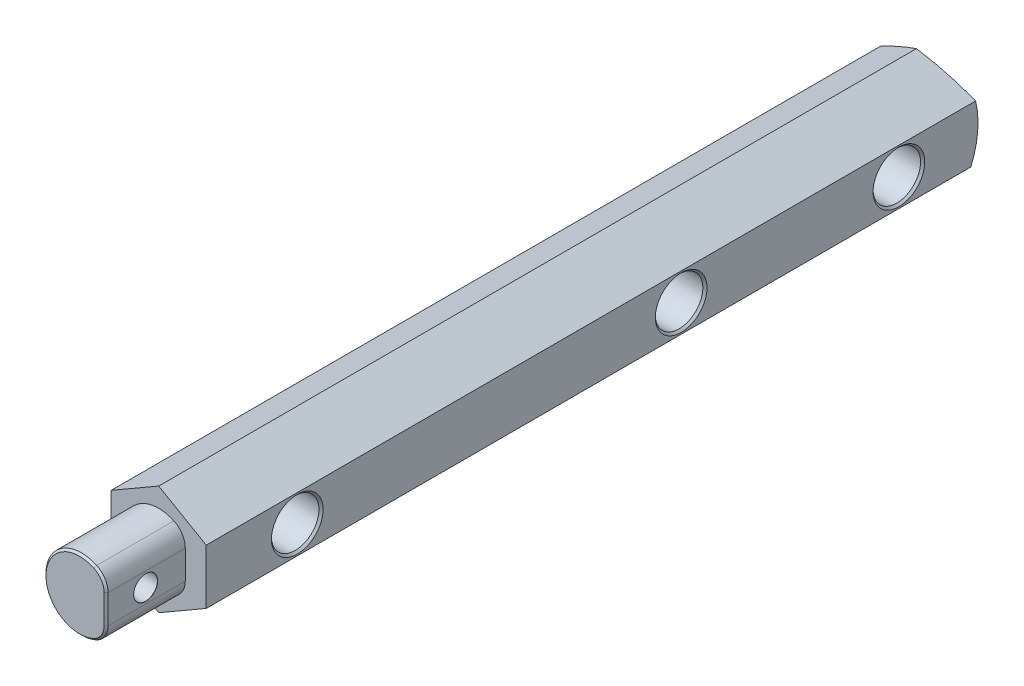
ISO-10303-21;
HEADER;
FILE_DESCRIPTION(('STEP AP214'),'2;1');
FILE_NAME('part.step','',(''),(''),'','','');
FILE_SCHEMA(('AUTOMOTIVE_DESIGN { 1 0 10303 214 1 1 1 1 }'));
ENDSEC;
DATA;
#1=APPLICATION_CONTEXT('core data for automotive mechanical design processes');
#2=APPLICATION_PROTOCOL_DEFINITION('international standard','automotive_design',2000,#1);
#3=PRODUCT_CONTEXT('',#1,'mechanical');
#4=PRODUCT('Part','Part','',(#3));
#5=PRODUCT_RELATED_PRODUCT_CATEGORY('part','',(#4));
#6=PRODUCT_DEFINITION_FORMATION('','',#4);
#7=PRODUCT_DEFINITION_CONTEXT('part definition',#1,'design');
#8=PRODUCT_DEFINITION('design','',#6,#7);
#9=PRODUCT_DEFINITION_SHAPE('','',#8);
#10=(LENGTH_UNIT() NAMED_UNIT(*) SI_UNIT(.MILLI.,.METRE.));
#11=(NAMED_UNIT(*) PLANE_ANGLE_UNIT() SI_UNIT($,.RADIAN.));
#12=(NAMED_UNIT(*) SI_UNIT($,.STERADIAN.) SOLID_ANGLE_UNIT());
#13=UNCERTAINTY_MEASURE_WITH_UNIT(LENGTH_MEASURE(1.E-05),#10,'distance_accuracy_value','');
#14=(GEOMETRIC_REPRESENTATION_CONTEXT(3) GLOBAL_UNCERTAINTY_ASSIGNED_CONTEXT((#13)) GLOBAL_UNIT_ASSIGNED_CONTEXT((#10,
#11,#12)) REPRESENTATION_CONTEXT('',''));
#15=CARTESIAN_POINT('',(0.,0.,0.));
#16=DIRECTION('',(0.,0.,1.));
#17=DIRECTION('',(1.,0.,0.));
#18=AXIS2_PLACEMENT_3D('',#15,#16,#17);
#19=CARTESIAN_POINT('',(11.9999999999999,6.92820323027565,195.));
#20=DIRECTION('',(-0.499999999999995,-0.866025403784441,0.));
#21=DIRECTION('',(0.866025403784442,-0.499999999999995,0.));
#22=AXIS2_PLACEMENT_3D('',#19,#20,#21);
#23=PLANE('',#22);
#24=DIRECTION('',(0.,0.,-1.));
#25=VECTOR('',#24,1.);
#26=CARTESIAN_POINT('',(11.9999999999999,6.92820323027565,195.));
#27=LINE('',#26,#25);
#28=CARTESIAN_POINT('',(11.9999999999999,6.92820323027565,195.));
#29=VERTEX_POINT('',#28);
#30=CARTESIAN_POINT('',(11.9999999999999,6.92820323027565,0.592597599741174));
#31=VERTEX_POINT('',#30);
#32=EDGE_CURVE('E145',#29,#31,#27,.T.);
#33=ORIENTED_EDGE('',*,*,#32,.T.);
#34=CARTESIAN_POINT('',(20.7846096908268,1.85640646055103,22.));
#35=DIRECTION('',(-0.499999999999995,-0.866025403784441,0.));
#36=DIRECTION('',(0.866025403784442,-0.499999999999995,0.));
#37=AXIS2_PLACEMENT_3D('',#34,#35,#36);
#38=ELLIPSE('',#37,44.0000000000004,22.);
#39=CARTESIAN_POINT('',(0.,13.856406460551,3.56091108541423));
#40=VERTEX_POINT('',#39);
#41=EDGE_CURVE('E139',#31,#40,#38,.F.);
#42=ORIENTED_EDGE('',*,*,#41,.T.);
#43=DIRECTION('',(0.,0.,-1.));
#44=VECTOR('',#43,1.);
#45=CARTESIAN_POINT('',(0.,13.856406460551,195.));
#46=LINE('',#45,#44);
#47=CARTESIAN_POINT('',(0.,13.856406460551,195.));
#48=VERTEX_POINT('',#47);
#49=EDGE_CURVE('E143',#48,#40,#46,.T.);
#50=ORIENTED_EDGE('',*,*,#49,.F.);
#51=DIRECTION('',(-0.866025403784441,0.499999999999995,0.));
#52=VECTOR('',#51,1.);
#53=CARTESIAN_POINT('',(11.9999999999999,6.92820323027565,195.));
#54=LINE('',#53,#52);
#55=EDGE_CURVE('E219',#29,#48,#54,.T.);
#56=ORIENTED_EDGE('',*,*,#55,.F.);
#57=EDGE_LOOP('',(#33,#42,#50,#56));
#58=FACE_BOUND('',#57,.T.);
#59=ADVANCED_FACE('F43',(#58),#23,.F.);
#60=CARTESIAN_POINT('',(0.,-13.856406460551,195.));
#61=DIRECTION('',(-0.500000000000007,0.866025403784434,0.));
#62=DIRECTION('',(-0.866025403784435,-0.500000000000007,0.));
#63=AXIS2_PLACEMENT_3D('',#60,#61,#62);
#64=PLANE('',#63);
#65=DIRECTION('',(0.,0.,-1.));
#66=VECTOR('',#65,1.);
#67=CARTESIAN_POINT('',(0.,-13.856406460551,195.));
#68=LINE('',#67,#66);
#69=CARTESIAN_POINT('',(0.,-13.856406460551,195.));
#70=VERTEX_POINT('',#69);
#71=CARTESIAN_POINT('',(0.,-13.8564064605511,6.6017043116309));
#72=VERTEX_POINT('',#71);
#73=EDGE_CURVE('E234',#70,#72,#68,.T.);
#74=ORIENTED_EDGE('',*,*,#73,.T.);
#75=CARTESIAN_POINT('',(27.2153903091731,1.85640646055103,22.));
#76=DIRECTION('',(-0.500000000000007,0.866025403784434,0.));
#77=DIRECTION('',(0.866025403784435,0.500000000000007,0.));
#78=AXIS2_PLACEMENT_3D('',#75,#76,#77);
#79=ELLIPSE('',#78,43.9999999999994,22.);
#80=CARTESIAN_POINT('',(12.0000000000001,-6.9282032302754,1.82995705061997));
#81=VERTEX_POINT('',#80);
#82=EDGE_CURVE('E148',#72,#81,#79,.F.);
#83=ORIENTED_EDGE('',*,*,#82,.T.);
#84=DIRECTION('',(0.,0.,-1.));
#85=VECTOR('',#84,1.);
#86=CARTESIAN_POINT('',(12.0000000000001,-6.9282032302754,195.));
#87=LINE('',#86,#85);
#88=CARTESIAN_POINT('',(12.0000000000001,-6.9282032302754,195.));
#89=VERTEX_POINT('',#88);
#90=EDGE_CURVE('E231',#89,#81,#87,.T.);
#91=ORIENTED_EDGE('',*,*,#90,.F.);
#92=DIRECTION('',(0.866025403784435,0.500000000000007,0.));
#93=VECTOR('',#92,1.);
#94=CARTESIAN_POINT('',(0.,-13.856406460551,195.));
#95=LINE('',#94,#93);
#96=EDGE_CURVE('E226',#70,#89,#95,.T.);
#97=ORIENTED_EDGE('',*,*,#96,.F.);
#98=EDGE_LOOP('',(#74,#83,#91,#97));
#99=FACE_BOUND('',#98,.T.);
#100=ADVANCED_FACE('F340',(#99),#64,.F.);
#101=CARTESIAN_POINT('',(12.0000000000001,-6.9282032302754,195.));
#102=DIRECTION('',(-1.,0.,0.));
#103=DIRECTION('',(0.,-1.,0.));
#104=AXIS2_PLACEMENT_3D('',#101,#102,#103);
#105=PLANE('',#104);
#106=CARTESIAN_POINT('',(12.,0.,75.));
#107=DIRECTION('',(1.,0.,0.));
#108=DIRECTION('',(0.,0.,-1.));
#109=AXIS2_PLACEMENT_3D('',#106,#107,#108);
#110=CIRCLE('',#109,6.525);
#111=CARTESIAN_POINT('',(12.,0.,68.475));
#112=VERTEX_POINT('',#111);
#113=EDGE_CURVE('E294',#112,#112,#110,.T.);
#114=ORIENTED_EDGE('',*,*,#113,.F.);
#115=EDGE_LOOP('',(#114));
#116=FACE_BOUND('',#115,.T.);
#117=CARTESIAN_POINT('',(12.,2.09924271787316E-13,20.));
#118=DIRECTION('',(1.,0.,0.));
#119=DIRECTION('',(0.,0.,-1.));
#120=AXIS2_PLACEMENT_3D('',#117,#118,#119);
#121=CIRCLE('',#120,6.525);
#122=CARTESIAN_POINT('',(12.,2.09924271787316E-13,13.475));
#123=VERTEX_POINT('',#122);
#124=EDGE_CURVE('E279',#123,#123,#121,.T.);
#125=ORIENTED_EDGE('',*,*,#124,.F.);
#126=EDGE_LOOP('',(#125));
#127=FACE_BOUND('',#126,.T.);
#128=CARTESIAN_POINT('',(12.,1.24692111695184E-13,172.));
#129=DIRECTION('',(1.,0.,0.));
#130=DIRECTION('',(0.,0.,-1.));
#131=AXIS2_PLACEMENT_3D('',#128,#129,#130);
#132=CIRCLE('',#131,6.525);
#133=CARTESIAN_POINT('',(12.,1.24692111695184E-13,165.475));
#134=VERTEX_POINT('',#133);
#135=EDGE_CURVE('E264',#134,#134,#132,.T.);
#136=ORIENTED_EDGE('',*,*,#135,.F.);
#137=EDGE_LOOP('',(#136));
#138=FACE_BOUND('',#137,.T.);
#139=ORIENTED_EDGE('',*,*,#90,.T.);
#140=CARTESIAN_POINT('',(12.,1.85640646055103,22.));
#141=DIRECTION('',(-1.,0.,0.));
#142=DIRECTION('',(0.,-1.,0.));
#143=AXIS2_PLACEMENT_3D('',#140,#141,#142);
#144=CIRCLE('',#143,22.);
#145=EDGE_CURVE('E147',#81,#31,#144,.F.);
#146=ORIENTED_EDGE('',*,*,#145,.T.);
#147=ORIENTED_EDGE('',*,*,#32,.F.);
#148=DIRECTION('',(0.,1.,0.));
#149=VECTOR('',#148,1.);
#150=CARTESIAN_POINT('',(12.0000000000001,-6.9282032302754,195.));
#151=LINE('',#150,#149);
#152=EDGE_CURVE('E228',#89,#29,#151,.T.);
#153=ORIENTED_EDGE('',*,*,#152,.F.);
#154=EDGE_LOOP('',(#139,#146,#147,#153));
#155=FACE_BOUND('',#154,.T.);
#156=ADVANCED_FACE('F346',(#116,#127,#138,#155),#105,.F.);
#157=CARTESIAN_POINT('',(0.,13.856406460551,195.));
#158=DIRECTION('',(0.500000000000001,-0.866025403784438,0.));
#159=DIRECTION('',(0.866025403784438,0.500000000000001,0.));
#160=AXIS2_PLACEMENT_3D('',#157,#158,#159);
#161=PLANE('',#160);
#162=CARTESIAN_POINT('',(-20.7846096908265,1.85640646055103,22.));
#163=DIRECTION('',(0.500000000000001,-0.866025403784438,0.));
#164=DIRECTION('',(0.866025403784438,0.500000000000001,0.));
#165=AXIS2_PLACEMENT_3D('',#162,#163,#164);
#166=ELLIPSE('',#165,43.9999999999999,22.);
#167=CARTESIAN_POINT('',(-12.,6.92820323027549,0.592597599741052));
#168=VERTEX_POINT('',#167);
#169=EDGE_CURVE('E151',#168,#40,#166,.T.);
#170=ORIENTED_EDGE('',*,*,#169,.F.);
#171=DIRECTION('',(0.,0.,-1.));
#172=VECTOR('',#171,1.);
#173=CARTESIAN_POINT('',(-12.,6.92820323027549,195.));
#174=LINE('',#173,#172);
#175=CARTESIAN_POINT('',(-12.,6.92820323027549,195.));
#176=VERTEX_POINT('',#175);
#177=EDGE_CURVE('E164',#176,#168,#174,.T.);
#178=ORIENTED_EDGE('',*,*,#177,.F.);
#179=DIRECTION('',(-0.866025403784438,-0.500000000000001,0.));
#180=VECTOR('',#179,1.);
#181=CARTESIAN_POINT('',(0.,13.856406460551,195.));
#182=LINE('',#181,#180);
#183=EDGE_CURVE('E161',#48,#176,#182,.T.);
#184=ORIENTED_EDGE('',*,*,#183,.F.);
#185=ORIENTED_EDGE('',*,*,#49,.T.);
#186=EDGE_LOOP('',(#170,#178,#184,#185));
#187=FACE_BOUND('',#186,.T.);
#188=ADVANCED_FACE('F160',(#187),#161,.F.);
#189=CARTESIAN_POINT('',(-12.,6.92820323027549,195.));
#190=DIRECTION('',(1.,0.,0.));
#191=DIRECTION('',(0.,1.,0.));
#192=AXIS2_PLACEMENT_3D('',#189,#190,#191);
#193=PLANE('',#192);
#194=CARTESIAN_POINT('',(-12.0000000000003,0.,75.));
#195=DIRECTION('',(1.,0.,0.));
#196=DIRECTION('',(0.,0.,-1.));
#197=AXIS2_PLACEMENT_3D('',#194,#195,#196);
#198=CIRCLE('',#197,3.24999999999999);
#199=CARTESIAN_POINT('',(-12.0000000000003,0.,71.75));
#200=VERTEX_POINT('',#199);
#201=EDGE_CURVE('E282',#200,#200,#198,.T.);
#202=ORIENTED_EDGE('',*,*,#201,.T.);
#203=EDGE_LOOP('',(#202));
#204=FACE_BOUND('',#203,.T.);
#205=CARTESIAN_POINT('',(-12.0000000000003,2.09924271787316E-13,20.));
#206=DIRECTION('',(1.,0.,0.));
#207=DIRECTION('',(0.,0.,-1.));
#208=AXIS2_PLACEMENT_3D('',#205,#206,#207);
#209=CIRCLE('',#208,3.24999999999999);
#210=CARTESIAN_POINT('',(-12.0000000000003,2.09924271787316E-13,16.75));
#211=VERTEX_POINT('',#210);
#212=EDGE_CURVE('E267',#211,#211,#209,.T.);
#213=ORIENTED_EDGE('',*,*,#212,.T.);
#214=EDGE_LOOP('',(#213));
#215=FACE_BOUND('',#214,.T.);
#216=CARTESIAN_POINT('',(-12.0000000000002,1.24692111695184E-13,172.));
#217=DIRECTION('',(1.,0.,0.));
#218=DIRECTION('',(0.,0.,-1.));
#219=AXIS2_PLACEMENT_3D('',#216,#217,#218);
#220=CIRCLE('',#219,3.24999999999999);
#221=CARTESIAN_POINT('',(-12.0000000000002,1.24692111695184E-13,168.75));
#222=VERTEX_POINT('',#221);
#223=EDGE_CURVE('E252',#222,#222,#220,.T.);
#224=ORIENTED_EDGE('',*,*,#223,.T.);
#225=EDGE_LOOP('',(#224));
#226=FACE_BOUND('',#225,.T.);
#227=CARTESIAN_POINT('',(-12.,1.85640646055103,22.));
#228=DIRECTION('',(1.,0.,0.));
#229=DIRECTION('',(0.,1.,0.));
#230=AXIS2_PLACEMENT_3D('',#227,#228,#229);
#231=CIRCLE('',#230,22.);
#232=CARTESIAN_POINT('',(-12.,-6.92820323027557,1.82995705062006));
#233=VERTEX_POINT('',#232);
#234=EDGE_CURVE('E154',#233,#168,#231,.T.);
#235=ORIENTED_EDGE('',*,*,#234,.F.);
#236=DIRECTION('',(0.,0.,-1.));
#237=VECTOR('',#236,1.);
#238=CARTESIAN_POINT('',(-12.,-6.92820323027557,195.));
#239=LINE('',#238,#237);
#240=CARTESIAN_POINT('',(-12.,-6.92820323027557,195.));
#241=VERTEX_POINT('',#240);
#242=EDGE_CURVE('E168',#241,#233,#239,.T.);
#243=ORIENTED_EDGE('',*,*,#242,.F.);
#244=DIRECTION('',(0.,-1.,0.));
#245=VECTOR('',#244,1.);
#246=CARTESIAN_POINT('',(-12.,6.92820323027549,195.));
#247=LINE('',#246,#245);
#248=EDGE_CURVE('E222',#176,#241,#247,.T.);
#249=ORIENTED_EDGE('',*,*,#248,.F.);
#250=ORIENTED_EDGE('',*,*,#177,.T.);
#251=EDGE_LOOP('',(#235,#243,#249,#250));
#252=FACE_BOUND('',#251,.T.);
#253=ADVANCED_FACE('F246',(#204,#215,#226,#252),#193,.F.);
#254=CARTESIAN_POINT('',(-12.,-6.92820323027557,195.));
#255=DIRECTION('',(0.499999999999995,0.866025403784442,0.));
#256=DIRECTION('',(-0.866025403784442,0.499999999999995,0.));
#257=AXIS2_PLACEMENT_3D('',#254,#255,#256);
#258=PLANE('',#257);
#259=CARTESIAN_POINT('',(-27.2153903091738,1.85640646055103,22.));
#260=DIRECTION('',(0.499999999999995,0.866025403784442,0.));
#261=DIRECTION('',(0.866025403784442,-0.499999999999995,0.));
#262=AXIS2_PLACEMENT_3D('',#259,#260,#261);
#263=ELLIPSE('',#262,44.0000000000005,22.);
#264=EDGE_CURVE('E243',#72,#233,#263,.T.);
#265=ORIENTED_EDGE('',*,*,#264,.F.);
#266=ORIENTED_EDGE('',*,*,#73,.F.);
#267=DIRECTION('',(0.866025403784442,-0.499999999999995,0.));
#268=VECTOR('',#267,1.);
#269=CARTESIAN_POINT('',(-12.,-6.92820323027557,195.));
#270=LINE('',#269,#268);
#271=EDGE_CURVE('E224',#241,#70,#270,.T.);
#272=ORIENTED_EDGE('',*,*,#271,.F.);
#273=ORIENTED_EDGE('',*,*,#242,.T.);
#274=EDGE_LOOP('',(#265,#266,#272,#273));
#275=FACE_BOUND('',#274,.T.);
#276=ADVANCED_FACE('F241',(#275),#258,.F.);
#277=CARTESIAN_POINT('',(0.,0.,195.));
#278=DIRECTION('',(0.,0.,1.));
#279=DIRECTION('',(1.,0.,0.));
#280=AXIS2_PLACEMENT_3D('',#277,#278,#279);
#281=PLANE('',#280);
#282=ORIENTED_EDGE('',*,*,#55,.T.);
#283=ORIENTED_EDGE('',*,*,#183,.T.);
#284=ORIENTED_EDGE('',*,*,#248,.T.);
#285=ORIENTED_EDGE('',*,*,#271,.T.);
#286=ORIENTED_EDGE('',*,*,#96,.T.);
#287=ORIENTED_EDGE('',*,*,#152,.T.);
#288=EDGE_LOOP('',(#282,#283,#284,#285,#286,#287));
#289=FACE_BOUND('',#288,.T.);
#290=DIRECTION('',(0.,1.,0.));
#291=VECTOR('',#290,1.);
#292=CARTESIAN_POINT('',(6.7,0.,195.));
#293=LINE('',#292,#291);
#294=CARTESIAN_POINT('',(6.7,-3.62077339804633,195.));
#295=VERTEX_POINT('',#294);
#296=CARTESIAN_POINT('',(6.7,3.62077339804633,195.));
#297=VERTEX_POINT('',#296);
#298=EDGE_CURVE('E217',#295,#297,#293,.T.);
#299=ORIENTED_EDGE('',*,*,#298,.F.);
#300=CARTESIAN_POINT('',(1.7,-3.62077339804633,195.));
#301=DIRECTION('',(0.,0.,1.));
#302=DIRECTION('',(1.,0.,0.));
#303=AXIS2_PLACEMENT_3D('',#300,#301,#302);
#304=CIRCLE('',#303,5.);
#305=CARTESIAN_POINT('',(3.825,-8.14674014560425,195.));
#306=VERTEX_POINT('',#305);
#307=EDGE_CURVE('E208',#295,#306,#304,.F.);
#308=ORIENTED_EDGE('',*,*,#307,.T.);
#309=CARTESIAN_POINT('',(0.,0.,195.));
#310=DIRECTION('',(0.,0.,1.));
#311=DIRECTION('',(1.,0.,0.));
#312=AXIS2_PLACEMENT_3D('',#309,#310,#311);
#313=CIRCLE('',#312,9.);
#314=CARTESIAN_POINT('',(3.825,8.14674014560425,195.));
#315=VERTEX_POINT('',#314);
#316=EDGE_CURVE('E211',#306,#315,#313,.F.);
#317=ORIENTED_EDGE('',*,*,#316,.T.);
#318=CARTESIAN_POINT('',(1.7,3.62077339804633,195.));
#319=DIRECTION('',(0.,0.,1.));
#320=DIRECTION('',(1.,0.,0.));
#321=AXIS2_PLACEMENT_3D('',#318,#319,#320);
#322=CIRCLE('',#321,5.);
#323=EDGE_CURVE('E214',#315,#297,#322,.F.);
#324=ORIENTED_EDGE('',*,*,#323,.T.);
#325=EDGE_LOOP('',(#299,#308,#317,#324));
#326=FACE_BOUND('',#325,.T.);
#327=ADVANCED_FACE('F309',(#289,#326),#281,.T.);
#328=CARTESIAN_POINT('',(6.7,0.,215.));
#329=DIRECTION('',(1.,0.,0.));
#330=DIRECTION('',(0.,1.,0.));
#331=AXIS2_PLACEMENT_3D('',#328,#329,#330);
#332=PLANE('',#331);
#333=CARTESIAN_POINT('',(6.7,0.,205.));
#334=DIRECTION('',(1.,0.,0.));
#335=DIRECTION('',(0.,0.,-1.));
#336=AXIS2_PLACEMENT_3D('',#333,#334,#335);
#337=CIRCLE('',#336,3.025);
#338=CARTESIAN_POINT('',(6.7,0.,201.975));
#339=VERTEX_POINT('',#338);
#340=EDGE_CURVE('E300',#339,#339,#337,.T.);
#341=ORIENTED_EDGE('',*,*,#340,.F.);
#342=EDGE_LOOP('',(#341));
#343=FACE_BOUND('',#342,.T.);
#344=DIRECTION('',(0.,0.,-1.));
#345=VECTOR('',#344,1.);
#346=CARTESIAN_POINT('',(6.7,3.62077339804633,215.));
#347=LINE('',#346,#345);
#348=CARTESIAN_POINT('',(6.7,3.62077339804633,214.5));
#349=VERTEX_POINT('',#348);
#350=EDGE_CURVE('E206',#349,#297,#347,.T.);
#351=ORIENTED_EDGE('',*,*,#350,.F.);
#352=DIRECTION('',(0.,-1.,0.));
#353=VECTOR('',#352,1.);
#354=CARTESIAN_POINT('',(6.7,0.,214.5));
#355=LINE('',#354,#353);
#356=CARTESIAN_POINT('',(6.7,-3.62077339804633,214.5));
#357=VERTEX_POINT('',#356);
#358=EDGE_CURVE('E181',#349,#357,#355,.T.);
#359=ORIENTED_EDGE('',*,*,#358,.T.);
#360=DIRECTION('',(0.,0.,-1.));
#361=VECTOR('',#360,1.);
#362=CARTESIAN_POINT('',(6.7,-3.62077339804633,215.));
#363=LINE('',#362,#361);
#364=EDGE_CURVE('E191',#357,#295,#363,.T.);
#365=ORIENTED_EDGE('',*,*,#364,.T.);
#366=ORIENTED_EDGE('',*,*,#298,.T.);
#367=EDGE_LOOP('',(#351,#359,#365,#366));
#368=FACE_BOUND('',#367,.T.);
#369=ADVANCED_FACE('F306',(#343,#368),#332,.T.);
#370=CARTESIAN_POINT('',(1.7,3.62077339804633,215.));
#371=DIRECTION('',(0.,0.,-1.));
#372=DIRECTION('',(-1.,0.,0.));
#373=AXIS2_PLACEMENT_3D('',#370,#371,#372);
#374=CYLINDRICAL_SURFACE('',#373,5.);
#375=DIRECTION('',(0.,0.,-1.));
#376=VECTOR('',#375,1.);
#377=CARTESIAN_POINT('',(3.825,8.14674014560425,215.));
#378=LINE('',#377,#376);
#379=CARTESIAN_POINT('',(3.825,8.14674014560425,214.5));
#380=VERTEX_POINT('',#379);
#381=EDGE_CURVE('E201',#380,#315,#378,.T.);
#382=ORIENTED_EDGE('',*,*,#381,.F.);
#383=CARTESIAN_POINT('',(1.7,3.62077339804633,214.5));
#384=DIRECTION('',(0.,0.,1.));
#385=DIRECTION('',(1.,0.,0.));
#386=AXIS2_PLACEMENT_3D('',#383,#384,#385);
#387=CIRCLE('',#386,5.);
#388=EDGE_CURVE('E58',#380,#349,#387,.F.);
#389=ORIENTED_EDGE('',*,*,#388,.T.);
#390=ORIENTED_EDGE('',*,*,#350,.T.);
#391=ORIENTED_EDGE('',*,*,#323,.F.);
#392=EDGE_LOOP('',(#382,#389,#390,#391));
#393=FACE_BOUND('',#392,.T.);
#394=ADVANCED_FACE('F308',(#393),#374,.T.);
#395=CARTESIAN_POINT('',(0.,0.,215.));
#396=DIRECTION('',(0.,0.,-1.));
#397=DIRECTION('',(-1.,0.,0.));
#398=AXIS2_PLACEMENT_3D('',#395,#396,#397);
#399=CYLINDRICAL_SURFACE('',#398,9.);
#400=CARTESIAN_POINT('',(-9.,0.,202.));
#401=CARTESIAN_POINT('',(-9.00000045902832,0.16369008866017,201.999999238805));
#402=CARTESIAN_POINT('',(-8.99549308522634,0.327375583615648,202.013440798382));
#403=CARTESIAN_POINT('',(-8.97795630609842,0.649925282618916,202.066687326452));
#404=CARTESIAN_POINT('',(-8.96492601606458,0.808788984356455,202.106495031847));
#405=CARTESIAN_POINT('',(-8.93175923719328,1.11699836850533,202.210957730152));
#406=CARTESIAN_POINT('',(-8.9116346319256,1.2663594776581,202.275571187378));
#407=CARTESIAN_POINT('',(-8.86633337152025,1.55212481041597,202.427623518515));
#408=CARTESIAN_POINT('',(-8.84115572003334,1.68852647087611,202.515066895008));
#409=CARTESIAN_POINT('',(-8.78742283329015,1.94922502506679,202.713477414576));
#410=CARTESIAN_POINT('',(-8.75878669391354,2.07301110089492,202.825093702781));
#411=CARTESIAN_POINT('',(-8.70180944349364,2.30049807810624,203.06730146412));
#412=CARTESIAN_POINT('',(-8.67346839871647,2.40419455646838,203.197897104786));
#413=CARTESIAN_POINT('',(-8.61939997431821,2.59147482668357,203.478955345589));
#414=CARTESIAN_POINT('',(-8.59377117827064,2.6743945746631,203.629881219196));
#415=CARTESIAN_POINT('',(-8.54925916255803,2.81345662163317,203.944528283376));
#416=CARTESIAN_POINT('',(-8.53037388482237,2.86960709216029,204.108245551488));
#417=CARTESIAN_POINT('',(-8.50233909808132,2.95162038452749,204.43801966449));
#418=CARTESIAN_POINT('',(-8.49288287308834,2.97844034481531,204.603811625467));
#419=CARTESIAN_POINT('',(-8.48386969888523,3.00402337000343,204.937791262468));
#420=CARTESIAN_POINT('',(-8.4843096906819,3.00279510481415,205.105978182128));
#421=CARTESIAN_POINT('',(-8.49477045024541,2.97305971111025,205.431809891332));
#422=CARTESIAN_POINT('',(-8.50435247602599,2.94580173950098,205.589585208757));
#423=CARTESIAN_POINT('',(-8.53129973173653,2.86681848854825,205.898180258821));
#424=CARTESIAN_POINT('',(-8.54866589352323,2.81509027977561,206.048999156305));
#425=CARTESIAN_POINT('',(-8.58953733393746,2.68781717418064,206.342238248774));
#426=CARTESIAN_POINT('',(-8.61313697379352,2.61190214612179,206.484484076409));
#427=CARTESIAN_POINT('',(-8.66377675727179,2.43866731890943,206.754612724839));
#428=CARTESIAN_POINT('',(-8.6908178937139,2.34134133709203,206.8824913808));
#429=CARTESIAN_POINT('',(-8.74701987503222,2.12204799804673,207.127274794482));
#430=CARTESIAN_POINT('',(-8.77621768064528,1.99905945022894,207.243258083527));
#431=CARTESIAN_POINT('',(-8.8322081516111,1.73501870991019,207.45319379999));
#432=CARTESIAN_POINT('',(-8.85900058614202,1.59396478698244,207.547144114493));
#433=CARTESIAN_POINT('',(-8.90751323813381,1.2958428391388,207.711088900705));
#434=CARTESIAN_POINT('',(-8.92918050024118,1.138629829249,207.780836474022));
#435=CARTESIAN_POINT('',(-8.96461701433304,0.813807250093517,207.892609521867));
#436=CARTESIAN_POINT('',(-8.97838900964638,0.646201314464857,207.93464462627));
#437=CARTESIAN_POINT('',(-8.99602881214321,0.313151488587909,207.988166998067));
#438=CARTESIAN_POINT('',(-9.00030005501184,0.147928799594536,208.000899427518));
#439=CARTESIAN_POINT('',(-8.99966708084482,-0.182325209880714,207.999001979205));
#440=CARTESIAN_POINT('',(-8.99476441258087,-0.347356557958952,207.98437672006));
#441=CARTESIAN_POINT('',(-8.97660074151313,-0.667559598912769,207.929164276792));
#442=CARTESIAN_POINT('',(-8.96358596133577,-0.822878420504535,207.889341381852));
#443=CARTESIAN_POINT('',(-8.9307554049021,-1.12456787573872,207.7858196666));
#444=CARTESIAN_POINT('',(-8.91093876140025,-1.27093736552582,207.722117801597));
#445=CARTESIAN_POINT('',(-8.86586793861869,-1.55486488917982,207.570788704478));
#446=CARTESIAN_POINT('',(-8.84048444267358,-1.69208987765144,207.48257622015));
#447=CARTESIAN_POINT('',(-8.78715761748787,-1.95019449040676,207.28541754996));
#448=CARTESIAN_POINT('',(-8.75921350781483,-2.07106910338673,207.176465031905));
#449=CARTESIAN_POINT('',(-8.70230543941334,-2.2987575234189,206.93506374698));
#450=CARTESIAN_POINT('',(-8.67335283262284,-2.40468290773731,206.801772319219));
#451=CARTESIAN_POINT('',(-8.61899919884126,-2.59277256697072,206.518685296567));
#452=CARTESIAN_POINT('',(-8.59359820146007,-2.67493664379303,206.368889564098));
#453=CARTESIAN_POINT('',(-8.54947175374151,-2.81279079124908,206.05698095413));
#454=CARTESIAN_POINT('',(-8.53073282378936,-2.86853439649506,205.894893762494));
#455=CARTESIAN_POINT('',(-8.50232496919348,-2.95168400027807,205.562864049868));
#456=CARTESIAN_POINT('',(-8.49265195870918,-2.97910276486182,205.392925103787));
#457=CARTESIAN_POINT('',(-8.48393576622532,-3.00382884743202,205.059408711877));
#458=CARTESIAN_POINT('',(-8.48437200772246,-3.00261077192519,204.89595297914));
#459=CARTESIAN_POINT('',(-8.49453809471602,-2.97372688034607,204.571704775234));
#460=CARTESIAN_POINT('',(-8.50426738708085,-2.94606263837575,204.410912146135));
#461=CARTESIAN_POINT('',(-8.53153572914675,-2.86611543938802,204.099593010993));
#462=CARTESIAN_POINT('',(-8.54892294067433,-2.81431003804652,203.948929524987));
#463=CARTESIAN_POINT('',(-8.58949196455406,-2.68793809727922,203.658317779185));
#464=CARTESIAN_POINT('',(-8.6126750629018,-2.6133665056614,203.518371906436));
#465=CARTESIAN_POINT('',(-8.66348487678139,-2.43978207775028,203.246548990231));
#466=CARTESIAN_POINT('',(-8.69126134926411,-2.33984472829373,203.115290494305));
#467=CARTESIAN_POINT('',(-8.74750068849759,-2.11992864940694,202.870930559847));
#468=CARTESIAN_POINT('',(-8.77596374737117,-1.99994425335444,202.757834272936));
#469=CARTESIAN_POINT('',(-8.83170091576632,-1.73772467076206,202.548566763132));
#470=CARTESIAN_POINT('',(-8.8588854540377,-1.59480454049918,202.453226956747));
#471=CARTESIAN_POINT('',(-8.90777973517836,-1.29407207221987,202.288028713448));
#472=CARTESIAN_POINT('',(-8.9294908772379,-1.13626355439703,202.218163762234));
#473=CARTESIAN_POINT('',(-8.96416545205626,-0.817480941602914,202.108835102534));
#474=CARTESIAN_POINT('',(-8.97747637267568,-0.656963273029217,202.06815260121));
#475=CARTESIAN_POINT('',(-8.99539221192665,-0.330961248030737,202.013739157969));
#476=CARTESIAN_POINT('',(-8.99999953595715,-0.165478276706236,202.00000076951));
#477=CARTESIAN_POINT('',(-9.,0.,202.));
#478=B_SPLINE_CURVE_WITH_KNOTS('',3,(#400,#401,#402,#403,#404,#405,#406,#407,#408,#409,#410,
#411,#412,#413,#414,#415,#416,#417,#418,#419,#420,#421,#422,#423,#424,#425,#426,#427,#428,#429,
#430,#431,#432,#433,#434,#435,#436,#437,#438,#439,#440,#441,#442,#443,#444,#445,#446,#447,#448,
#449,#450,#451,#452,#453,#454,#455,#456,#457,#458,#459,#460,#461,#462,#463,#464,#465,#466,#467,
#468,#469,#470,#471,#472,#473,#474,#475,#476,#477),.UNSPECIFIED.,.T.,.F.,(4,2,2,2,2,2,2,2,2,2,2,
2,2,2,2,2,2,2,2,2,2,2,2,2,2,2,2,2,2,2,2,2,2,2,2,2,2,2,4),(0.,0.490461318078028,
0.980973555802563,1.47066801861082,1.96045913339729,2.46554052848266,2.97073299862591,
3.49045154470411,4.01001134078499,4.51205777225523,5.01394901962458,5.49290479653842,
5.97191792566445,6.45864513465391,6.94551307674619,7.45779917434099,7.97013437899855,
8.48755216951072,9.00479006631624,9.49960749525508,9.99434139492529,10.4747447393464,
10.9552093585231,11.4483119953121,11.9415654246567,12.4572306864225,12.9729002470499,
13.4875204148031,14.0019085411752,14.4898699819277,14.9778023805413,15.4564676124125,
15.9352391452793,16.4349020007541,16.9347063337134,17.453989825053,17.9731404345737,
18.4690967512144,18.9649159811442),.UNSPECIFIED.);
#479=CARTESIAN_POINT('',(-9.,0.,202.));
#480=VERTEX_POINT('',#479);
#481=EDGE_CURVE('E48',#480,#480,#478,.T.);
#482=ORIENTED_EDGE('',*,*,#481,.T.);
#483=EDGE_LOOP('',(#482));
#484=FACE_BOUND('',#483,.T.);
#485=DIRECTION('',(0.,0.,-1.));
#486=VECTOR('',#485,1.);
#487=CARTESIAN_POINT('',(3.825,-8.14674014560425,215.));
#488=LINE('',#487,#486);
#489=CARTESIAN_POINT('',(3.825,-8.14674014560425,214.5));
#490=VERTEX_POINT('',#489);
#491=EDGE_CURVE('E195',#490,#306,#488,.T.);
#492=ORIENTED_EDGE('',*,*,#491,.F.);
#493=CARTESIAN_POINT('',(0.,0.,214.5));
#494=DIRECTION('',(0.,0.,1.));
#495=DIRECTION('',(1.,0.,0.));
#496=AXIS2_PLACEMENT_3D('',#493,#494,#495);
#497=CIRCLE('',#496,9.);
#498=EDGE_CURVE('E11',#490,#380,#497,.F.);
#499=ORIENTED_EDGE('',*,*,#498,.T.);
#500=ORIENTED_EDGE('',*,*,#381,.T.);
#501=ORIENTED_EDGE('',*,*,#316,.F.);
#502=EDGE_LOOP('',(#492,#499,#500,#501));
#503=FACE_BOUND('',#502,.T.);
#504=ADVANCED_FACE('F329',(#484,#503),#399,.T.);
#505=CARTESIAN_POINT('',(1.7,-3.62077339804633,215.));
#506=DIRECTION('',(0.,0.,-1.));
#507=DIRECTION('',(-1.,0.,0.));
#508=AXIS2_PLACEMENT_3D('',#505,#506,#507);
#509=CYLINDRICAL_SURFACE('',#508,5.);
#510=ORIENTED_EDGE('',*,*,#364,.F.);
#511=CARTESIAN_POINT('',(1.7,-3.62077339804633,214.5));
#512=DIRECTION('',(0.,0.,1.));
#513=DIRECTION('',(1.,0.,0.));
#514=AXIS2_PLACEMENT_3D('',#511,#512,#513);
#515=CIRCLE('',#514,5.);
#516=EDGE_CURVE('E178',#357,#490,#515,.F.);
#517=ORIENTED_EDGE('',*,*,#516,.T.);
#518=ORIENTED_EDGE('',*,*,#491,.T.);
#519=ORIENTED_EDGE('',*,*,#307,.F.);
#520=EDGE_LOOP('',(#510,#517,#518,#519));
#521=FACE_BOUND('',#520,.T.);
#522=ADVANCED_FACE('F327',(#521),#509,.T.);
#523=CARTESIAN_POINT('',(0.,0.,215.));
#524=DIRECTION('',(0.,0.,1.));
#525=DIRECTION('',(1.,0.,0.));
#526=AXIS2_PLACEMENT_3D('',#523,#524,#525);
#527=PLANE('',#526);
#528=CARTESIAN_POINT('',(0.,0.,215.));
#529=DIRECTION('',(0.,0.,1.));
#530=DIRECTION('',(1.,0.,0.));
#531=AXIS2_PLACEMENT_3D('',#528,#529,#530);
#532=CIRCLE('',#531,8.50000000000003);
#533=CARTESIAN_POINT('',(3.61250000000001,7.69414347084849,215.));
#534=VERTEX_POINT('',#533);
#535=CARTESIAN_POINT('',(3.61250000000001,-7.69414347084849,215.));
#536=VERTEX_POINT('',#535);
#537=EDGE_CURVE('E163',#534,#536,#532,.T.);
#538=ORIENTED_EDGE('',*,*,#537,.T.);
#539=CARTESIAN_POINT('',(1.7,-3.62077339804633,215.));
#540=DIRECTION('',(0.,0.,1.));
#541=DIRECTION('',(1.,0.,0.));
#542=AXIS2_PLACEMENT_3D('',#539,#540,#541);
#543=CIRCLE('',#542,4.50000000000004);
#544=CARTESIAN_POINT('',(6.20000000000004,-3.62077339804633,215.));
#545=VERTEX_POINT('',#544);
#546=EDGE_CURVE('E175',#536,#545,#543,.T.);
#547=ORIENTED_EDGE('',*,*,#546,.T.);
#548=DIRECTION('',(0.,1.,0.));
#549=VECTOR('',#548,1.);
#550=CARTESIAN_POINT('',(6.20000000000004,0.,215.));
#551=LINE('',#550,#549);
#552=CARTESIAN_POINT('',(6.20000000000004,3.62077339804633,215.));
#553=VERTEX_POINT('',#552);
#554=EDGE_CURVE('E173',#545,#553,#551,.T.);
#555=ORIENTED_EDGE('',*,*,#554,.T.);
#556=CARTESIAN_POINT('',(1.7,3.62077339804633,215.));
#557=DIRECTION('',(0.,0.,1.));
#558=DIRECTION('',(1.,0.,0.));
#559=AXIS2_PLACEMENT_3D('',#556,#557,#558);
#560=CIRCLE('',#559,4.50000000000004);
#561=EDGE_CURVE('E166',#553,#534,#560,.T.);
#562=ORIENTED_EDGE('',*,*,#561,.T.);
#563=EDGE_LOOP('',(#538,#547,#555,#562));
#564=FACE_BOUND('',#563,.T.);
#565=ADVANCED_FACE('F368',(#564),#527,.T.);
#566=CARTESIAN_POINT('',(1.7,3.62077339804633,215.));
#567=DIRECTION('',(0.,0.,-1.));
#568=DIRECTION('',(-1.,0.,0.));
#569=AXIS2_PLACEMENT_3D('',#566,#567,#568);
#570=CONICAL_SURFACE('',#569,4.50000000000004,0.78539816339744);
#571=DIRECTION('',(-0.707106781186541,0.,0.707106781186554));
#572=VECTOR('',#571,1.);
#573=CARTESIAN_POINT('',(6.7,3.62077339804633,214.5));
#574=LINE('',#573,#572);
#575=EDGE_CURVE('E187',#349,#553,#574,.T.);
#576=ORIENTED_EDGE('',*,*,#575,.F.);
#577=ORIENTED_EDGE('',*,*,#388,.F.);
#578=DIRECTION('',(0.30052038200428,0.6400683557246,-0.707106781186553));
#579=VECTOR('',#578,1.);
#580=CARTESIAN_POINT('',(3.61250000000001,7.69414347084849,215.));
#581=LINE('',#580,#579);
#582=EDGE_CURVE('E189',#534,#380,#581,.T.);
#583=ORIENTED_EDGE('',*,*,#582,.F.);
#584=ORIENTED_EDGE('',*,*,#561,.F.);
#585=EDGE_LOOP('',(#576,#577,#583,#584));
#586=FACE_BOUND('',#585,.T.);
#587=ADVANCED_FACE('F46',(#586),#570,.T.);
#588=CARTESIAN_POINT('',(0.,0.,215.));
#589=DIRECTION('',(0.,0.,-1.));
#590=DIRECTION('',(-1.,0.,0.));
#591=AXIS2_PLACEMENT_3D('',#588,#589,#590);
#592=CONICAL_SURFACE('',#591,8.50000000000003,0.785398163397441);
#593=ORIENTED_EDGE('',*,*,#582,.T.);
#594=ORIENTED_EDGE('',*,*,#498,.F.);
#595=DIRECTION('',(0.30052038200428,-0.6400683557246,-0.707106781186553));
#596=VECTOR('',#595,1.);
#597=CARTESIAN_POINT('',(3.61250000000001,-7.69414347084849,215.));
#598=LINE('',#597,#596);
#599=EDGE_CURVE('E185',#536,#490,#598,.T.);
#600=ORIENTED_EDGE('',*,*,#599,.F.);
#601=ORIENTED_EDGE('',*,*,#537,.F.);
#602=EDGE_LOOP('',(#593,#594,#600,#601));
#603=FACE_BOUND('',#602,.T.);
#604=ADVANCED_FACE('F361',(#603),#592,.T.);
#605=CARTESIAN_POINT('',(6.7,0.,214.5));
#606=DIRECTION('',(-0.707106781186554,0.,-0.707106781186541));
#607=DIRECTION('',(0.,-1.,0.));
#608=AXIS2_PLACEMENT_3D('',#605,#606,#607);
#609=PLANE('',#608);
#610=ORIENTED_EDGE('',*,*,#575,.T.);
#611=ORIENTED_EDGE('',*,*,#554,.F.);
#612=DIRECTION('',(-0.707106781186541,0.,0.707106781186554));
#613=VECTOR('',#612,1.);
#614=CARTESIAN_POINT('',(6.7,-3.62077339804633,214.5));
#615=LINE('',#614,#613);
#616=EDGE_CURVE('E158',#357,#545,#615,.T.);
#617=ORIENTED_EDGE('',*,*,#616,.F.);
#618=ORIENTED_EDGE('',*,*,#358,.F.);
#619=EDGE_LOOP('',(#610,#611,#617,#618));
#620=FACE_BOUND('',#619,.T.);
#621=ADVANCED_FACE('F320',(#620),#609,.F.);
#622=CARTESIAN_POINT('',(1.7,-3.62077339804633,215.));
#623=DIRECTION('',(0.,0.,-1.));
#624=DIRECTION('',(-1.,0.,0.));
#625=AXIS2_PLACEMENT_3D('',#622,#623,#624);
#626=CONICAL_SURFACE('',#625,4.50000000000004,0.78539816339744);
#627=ORIENTED_EDGE('',*,*,#599,.T.);
#628=ORIENTED_EDGE('',*,*,#516,.F.);
#629=ORIENTED_EDGE('',*,*,#616,.T.);
#630=ORIENTED_EDGE('',*,*,#546,.F.);
#631=EDGE_LOOP('',(#627,#628,#629,#630));
#632=FACE_BOUND('',#631,.T.);
#633=ADVANCED_FACE('F324',(#632),#626,.T.);
#634=CARTESIAN_POINT('',(-222.,1.85640646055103,22.));
#635=DIRECTION('',(1.,0.,0.));
#636=DIRECTION('',(0.,0.,-1.));
#637=AXIS2_PLACEMENT_3D('',#634,#635,#636);
#638=CYLINDRICAL_SURFACE('',#637,22.);
#639=ORIENTED_EDGE('',*,*,#169,.T.);
#640=ORIENTED_EDGE('',*,*,#41,.F.);
#641=ORIENTED_EDGE('',*,*,#145,.F.);
#642=ORIENTED_EDGE('',*,*,#82,.F.);
#643=ORIENTED_EDGE('',*,*,#264,.T.);
#644=ORIENTED_EDGE('',*,*,#234,.T.);
#645=EDGE_LOOP('',(#639,#640,#641,#642,#643,#644));
#646=FACE_BOUND('',#645,.T.);
#647=ADVANCED_FACE('F152',(#646),#638,.T.);
#648=CARTESIAN_POINT('',(12.,1.24692111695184E-13,172.));
#649=DIRECTION('',(1.,0.,0.));
#650=DIRECTION('',(0.,0.,-1.));
#651=AXIS2_PLACEMENT_3D('',#648,#649,#650);
#652=CYLINDRICAL_SURFACE('',#651,3.25);
#653=ORIENTED_EDGE('',*,*,#223,.F.);
#654=EDGE_LOOP('',(#653));
#655=FACE_BOUND('',#654,.T.);
#656=CARTESIAN_POINT('',(-2.99999999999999,1.24692111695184E-13,172.));
#657=DIRECTION('',(1.,0.,0.));
#658=DIRECTION('',(0.,0.,-1.));
#659=AXIS2_PLACEMENT_3D('',#656,#657,#658);
#660=CIRCLE('',#659,3.25);
#661=CARTESIAN_POINT('',(-2.99999999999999,1.24692111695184E-13,168.75));
#662=VERTEX_POINT('',#661);
#663=EDGE_CURVE('E255',#662,#662,#660,.T.);
#664=ORIENTED_EDGE('',*,*,#663,.T.);
#665=EDGE_LOOP('',(#664));
#666=FACE_BOUND('',#665,.T.);
#667=ADVANCED_FACE('F381',(#655,#666),#652,.F.);
#668=CARTESIAN_POINT('',(-2.99999999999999,6.00000000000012,172.));
#669=DIRECTION('',(-1.,0.,0.));
#670=DIRECTION('',(0.,0.,1.));
#671=AXIS2_PLACEMENT_3D('',#668,#669,#670);
#672=PLANE('',#671);
#673=ORIENTED_EDGE('',*,*,#663,.F.);
#674=EDGE_LOOP('',(#673));
#675=FACE_BOUND('',#674,.T.);
#676=CARTESIAN_POINT('',(-2.99999999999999,1.24692111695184E-13,172.));
#677=DIRECTION('',(1.,0.,0.));
#678=DIRECTION('',(0.,0.,-1.));
#679=AXIS2_PLACEMENT_3D('',#676,#677,#678);
#680=CIRCLE('',#679,5.99999999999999);
#681=CARTESIAN_POINT('',(-2.99999999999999,1.24692111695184E-13,166.));
#682=VERTEX_POINT('',#681);
#683=EDGE_CURVE('E258',#682,#682,#680,.T.);
#684=ORIENTED_EDGE('',*,*,#683,.T.);
#685=EDGE_LOOP('',(#684));
#686=FACE_BOUND('',#685,.T.);
#687=ADVANCED_FACE('F384',(#675,#686),#672,.F.);
#688=CARTESIAN_POINT('',(12.,1.24692111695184E-13,172.));
#689=DIRECTION('',(1.,0.,0.));
#690=DIRECTION('',(0.,0.,-1.));
#691=AXIS2_PLACEMENT_3D('',#688,#689,#690);
#692=CYLINDRICAL_SURFACE('',#691,6.);
#693=ORIENTED_EDGE('',*,*,#683,.F.);
#694=EDGE_LOOP('',(#693));
#695=FACE_BOUND('',#694,.T.);
#696=CARTESIAN_POINT('',(11.475,1.24692111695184E-13,172.));
#697=DIRECTION('',(1.,0.,0.));
#698=DIRECTION('',(0.,0.,-1.));
#699=AXIS2_PLACEMENT_3D('',#696,#697,#698);
#700=CIRCLE('',#699,6.);
#701=CARTESIAN_POINT('',(11.475,1.24692111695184E-13,166.));
#702=VERTEX_POINT('',#701);
#703=EDGE_CURVE('E261',#702,#702,#700,.T.);
#704=ORIENTED_EDGE('',*,*,#703,.T.);
#705=EDGE_LOOP('',(#704));
#706=FACE_BOUND('',#705,.T.);
#707=ADVANCED_FACE('F388',(#695,#706),#692,.F.);
#708=CARTESIAN_POINT('',(12.,1.24692111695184E-13,172.));
#709=DIRECTION('',(1.,0.,0.));
#710=DIRECTION('',(0.,0.,-1.));
#711=AXIS2_PLACEMENT_3D('',#708,#709,#710);
#712=CONICAL_SURFACE('',#711,6.525,0.78539816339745);
#713=ORIENTED_EDGE('',*,*,#703,.F.);
#714=EDGE_LOOP('',(#713));
#715=FACE_BOUND('',#714,.T.);
#716=ORIENTED_EDGE('',*,*,#135,.T.);
#717=EDGE_LOOP('',(#716));
#718=FACE_BOUND('',#717,.T.);
#719=ADVANCED_FACE('F392',(#715,#718),#712,.F.);
#720=CARTESIAN_POINT('',(12.,2.09924271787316E-13,20.));
#721=DIRECTION('',(1.,0.,0.));
#722=DIRECTION('',(0.,0.,-1.));
#723=AXIS2_PLACEMENT_3D('',#720,#721,#722);
#724=CYLINDRICAL_SURFACE('',#723,3.25);
#725=ORIENTED_EDGE('',*,*,#212,.F.);
#726=EDGE_LOOP('',(#725));
#727=FACE_BOUND('',#726,.T.);
#728=CARTESIAN_POINT('',(0.,2.09924271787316E-13,20.));
#729=DIRECTION('',(1.,0.,0.));
#730=DIRECTION('',(0.,0.,-1.));
#731=AXIS2_PLACEMENT_3D('',#728,#729,#730);
#732=CIRCLE('',#731,3.25);
#733=CARTESIAN_POINT('',(0.,2.09924271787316E-13,16.75));
#734=VERTEX_POINT('',#733);
#735=EDGE_CURVE('E270',#734,#734,#732,.T.);
#736=ORIENTED_EDGE('',*,*,#735,.T.);
#737=EDGE_LOOP('',(#736));
#738=FACE_BOUND('',#737,.T.);
#739=ADVANCED_FACE('F396',(#727,#738),#724,.F.);
#740=CARTESIAN_POINT('',(0.,6.00000000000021,20.));
#741=DIRECTION('',(-1.,0.,0.));
#742=DIRECTION('',(0.,0.,1.));
#743=AXIS2_PLACEMENT_3D('',#740,#741,#742);
#744=PLANE('',#743);
#745=ORIENTED_EDGE('',*,*,#735,.F.);
#746=EDGE_LOOP('',(#745));
#747=FACE_BOUND('',#746,.T.);
#748=CARTESIAN_POINT('',(0.,2.09924271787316E-13,20.));
#749=DIRECTION('',(1.,0.,0.));
#750=DIRECTION('',(0.,0.,-1.));
#751=AXIS2_PLACEMENT_3D('',#748,#749,#750);
#752=CIRCLE('',#751,6.);
#753=CARTESIAN_POINT('',(0.,2.09924271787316E-13,14.));
#754=VERTEX_POINT('',#753);
#755=EDGE_CURVE('E273',#754,#754,#752,.T.);
#756=ORIENTED_EDGE('',*,*,#755,.T.);
#757=EDGE_LOOP('',(#756));
#758=FACE_BOUND('',#757,.T.);
#759=ADVANCED_FACE('F400',(#747,#758),#744,.F.);
#760=CARTESIAN_POINT('',(12.,2.09924271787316E-13,20.));
#761=DIRECTION('',(1.,0.,0.));
#762=DIRECTION('',(0.,0.,-1.));
#763=AXIS2_PLACEMENT_3D('',#760,#761,#762);
#764=CYLINDRICAL_SURFACE('',#763,6.);
#765=ORIENTED_EDGE('',*,*,#755,.F.);
#766=EDGE_LOOP('',(#765));
#767=FACE_BOUND('',#766,.T.);
#768=CARTESIAN_POINT('',(11.475,2.09924271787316E-13,20.));
#769=DIRECTION('',(1.,0.,0.));
#770=DIRECTION('',(0.,0.,-1.));
#771=AXIS2_PLACEMENT_3D('',#768,#769,#770);
#772=CIRCLE('',#771,5.99999999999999);
#773=CARTESIAN_POINT('',(11.475,2.09924271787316E-13,14.));
#774=VERTEX_POINT('',#773);
#775=EDGE_CURVE('E276',#774,#774,#772,.T.);
#776=ORIENTED_EDGE('',*,*,#775,.T.);
#777=EDGE_LOOP('',(#776));
#778=FACE_BOUND('',#777,.T.);
#779=ADVANCED_FACE('F404',(#767,#778),#764,.F.);
#780=CARTESIAN_POINT('',(12.,2.09924271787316E-13,20.));
#781=DIRECTION('',(1.,0.,0.));
#782=DIRECTION('',(0.,0.,-1.));
#783=AXIS2_PLACEMENT_3D('',#780,#781,#782);
#784=CONICAL_SURFACE('',#783,6.525,0.785398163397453);
#785=ORIENTED_EDGE('',*,*,#775,.F.);
#786=EDGE_LOOP('',(#785));
#787=FACE_BOUND('',#786,.T.);
#788=ORIENTED_EDGE('',*,*,#124,.T.);
#789=EDGE_LOOP('',(#788));
#790=FACE_BOUND('',#789,.T.);
#791=ADVANCED_FACE('F408',(#787,#790),#784,.F.);
#792=CARTESIAN_POINT('',(12.,0.,75.));
#793=DIRECTION('',(1.,0.,0.));
#794=DIRECTION('',(0.,0.,-1.));
#795=AXIS2_PLACEMENT_3D('',#792,#793,#794);
#796=CYLINDRICAL_SURFACE('',#795,3.25);
#797=ORIENTED_EDGE('',*,*,#201,.F.);
#798=EDGE_LOOP('',(#797));
#799=FACE_BOUND('',#798,.T.);
#800=CARTESIAN_POINT('',(0.,0.,75.));
#801=DIRECTION('',(1.,0.,0.));
#802=DIRECTION('',(0.,0.,-1.));
#803=AXIS2_PLACEMENT_3D('',#800,#801,#802);
#804=CIRCLE('',#803,3.25);
#805=CARTESIAN_POINT('',(0.,0.,71.75));
#806=VERTEX_POINT('',#805);
#807=EDGE_CURVE('E285',#806,#806,#804,.T.);
#808=ORIENTED_EDGE('',*,*,#807,.T.);
#809=EDGE_LOOP('',(#808));
#810=FACE_BOUND('',#809,.T.);
#811=ADVANCED_FACE('F412',(#799,#810),#796,.F.);
#812=CARTESIAN_POINT('',(0.,6.00000000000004,75.));
#813=DIRECTION('',(-1.,0.,0.));
#814=DIRECTION('',(0.,0.,1.));
#815=AXIS2_PLACEMENT_3D('',#812,#813,#814);
#816=PLANE('',#815);
#817=ORIENTED_EDGE('',*,*,#807,.F.);
#818=EDGE_LOOP('',(#817));
#819=FACE_BOUND('',#818,.T.);
#820=CARTESIAN_POINT('',(0.,0.,75.));
#821=DIRECTION('',(1.,0.,0.));
#822=DIRECTION('',(0.,0.,-1.));
#823=AXIS2_PLACEMENT_3D('',#820,#821,#822);
#824=CIRCLE('',#823,6.);
#825=CARTESIAN_POINT('',(0.,0.,69.));
#826=VERTEX_POINT('',#825);
#827=EDGE_CURVE('E288',#826,#826,#824,.T.);
#828=ORIENTED_EDGE('',*,*,#827,.T.);
#829=EDGE_LOOP('',(#828));
#830=FACE_BOUND('',#829,.T.);
#831=ADVANCED_FACE('F416',(#819,#830),#816,.F.);
#832=CARTESIAN_POINT('',(12.,0.,75.));
#833=DIRECTION('',(1.,0.,0.));
#834=DIRECTION('',(0.,0.,-1.));
#835=AXIS2_PLACEMENT_3D('',#832,#833,#834);
#836=CYLINDRICAL_SURFACE('',#835,6.);
#837=ORIENTED_EDGE('',*,*,#827,.F.);
#838=EDGE_LOOP('',(#837));
#839=FACE_BOUND('',#838,.T.);
#840=CARTESIAN_POINT('',(11.475,0.,75.));
#841=DIRECTION('',(1.,0.,0.));
#842=DIRECTION('',(0.,0.,-1.));
#843=AXIS2_PLACEMENT_3D('',#840,#841,#842);
#844=CIRCLE('',#843,5.99999999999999);
#845=CARTESIAN_POINT('',(11.475,0.,69.));
#846=VERTEX_POINT('',#845);
#847=EDGE_CURVE('E291',#846,#846,#844,.T.);
#848=ORIENTED_EDGE('',*,*,#847,.T.);
#849=EDGE_LOOP('',(#848));
#850=FACE_BOUND('',#849,.T.);
#851=ADVANCED_FACE('F420',(#839,#850),#836,.F.);
#852=CARTESIAN_POINT('',(12.,0.,75.));
#853=DIRECTION('',(1.,0.,0.));
#854=DIRECTION('',(0.,0.,-1.));
#855=AXIS2_PLACEMENT_3D('',#852,#853,#854);
#856=CONICAL_SURFACE('',#855,6.525,0.785398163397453);
#857=ORIENTED_EDGE('',*,*,#847,.F.);
#858=EDGE_LOOP('',(#857));
#859=FACE_BOUND('',#858,.T.);
#860=ORIENTED_EDGE('',*,*,#113,.T.);
#861=EDGE_LOOP('',(#860));
#862=FACE_BOUND('',#861,.T.);
#863=ADVANCED_FACE('F424',(#859,#862),#856,.F.);
#864=CARTESIAN_POINT('',(6.7,0.,205.));
#865=DIRECTION('',(1.,0.,0.));
#866=DIRECTION('',(0.,0.,-1.));
#867=AXIS2_PLACEMENT_3D('',#864,#865,#866);
#868=CYLINDRICAL_SURFACE('',#867,3.);
#869=CARTESIAN_POINT('',(6.675,0.,205.));
#870=DIRECTION('',(1.,0.,0.));
#871=DIRECTION('',(0.,0.,-1.));
#872=AXIS2_PLACEMENT_3D('',#869,#870,#871);
#873=CIRCLE('',#872,3.);
#874=CARTESIAN_POINT('',(6.675,0.,202.));
#875=VERTEX_POINT('',#874);
#876=EDGE_CURVE('E297',#875,#875,#873,.T.);
#877=ORIENTED_EDGE('',*,*,#876,.T.);
#878=EDGE_LOOP('',(#877));
#879=FACE_BOUND('',#878,.T.);
#880=ORIENTED_EDGE('',*,*,#481,.F.);
#881=EDGE_LOOP('',(#880));
#882=FACE_BOUND('',#881,.T.);
#883=ADVANCED_FACE('F427',(#879,#882),#868,.F.);
#884=CARTESIAN_POINT('',(6.7,0.,205.));
#885=DIRECTION('',(1.,0.,0.));
#886=DIRECTION('',(0.,0.,-1.));
#887=AXIS2_PLACEMENT_3D('',#884,#885,#886);
#888=CONICAL_SURFACE('',#887,3.025,0.785398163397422);
#889=ORIENTED_EDGE('',*,*,#876,.F.);
#890=EDGE_LOOP('',(#889));
#891=FACE_BOUND('',#890,.T.);
#892=ORIENTED_EDGE('',*,*,#340,.T.);
#893=EDGE_LOOP('',(#892));
#894=FACE_BOUND('',#893,.T.);
#895=ADVANCED_FACE('F304',(#891,#894),#888,.F.);
#896=CLOSED_SHELL('',(#59,#100,#156,#188,#253,#276,#327,#369,#394,#504,#522,#565,#587,#604,#621,
#633,#647,#667,#687,#707,#719,#739,#759,#779,#791,#811,#831,#851,#863,#883,#895));
#897=MANIFOLD_SOLID_BREP('B2',#896);
#898=ADVANCED_BREP_SHAPE_REPRESENTATION('',(#18,#897),#14);
#899=SHAPE_DEFINITION_REPRESENTATION(#9,#898);
ENDSEC;
END-ISO-10303-21;
